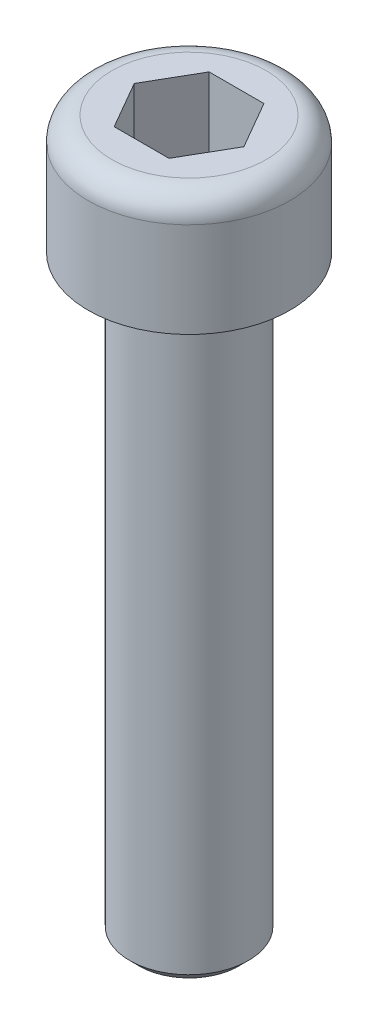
ISO-10303-21;
HEADER;
FILE_DESCRIPTION(('STEP AP214'),'2;1');
FILE_NAME('part.step','',(''),(''),'','','');
FILE_SCHEMA(('AUTOMOTIVE_DESIGN { 1 0 10303 214 1 1 1 1 }'));
ENDSEC;
DATA;
#1=APPLICATION_CONTEXT('core data for automotive mechanical design processes');
#2=APPLICATION_PROTOCOL_DEFINITION('international standard','automotive_design',2000,#1);
#3=PRODUCT_CONTEXT('',#1,'mechanical');
#4=PRODUCT('Part','Part','',(#3));
#5=PRODUCT_RELATED_PRODUCT_CATEGORY('part','',(#4));
#6=PRODUCT_DEFINITION_FORMATION('','',#4);
#7=PRODUCT_DEFINITION_CONTEXT('part definition',#1,'design');
#8=PRODUCT_DEFINITION('design','',#6,#7);
#9=PRODUCT_DEFINITION_SHAPE('','',#8);
#10=(LENGTH_UNIT() NAMED_UNIT(*) SI_UNIT(.MILLI.,.METRE.));
#11=(NAMED_UNIT(*) PLANE_ANGLE_UNIT() SI_UNIT($,.RADIAN.));
#12=(NAMED_UNIT(*) SI_UNIT($,.STERADIAN.) SOLID_ANGLE_UNIT());
#13=UNCERTAINTY_MEASURE_WITH_UNIT(LENGTH_MEASURE(1.E-05),#10,'distance_accuracy_value','');
#14=(GEOMETRIC_REPRESENTATION_CONTEXT(3) GLOBAL_UNCERTAINTY_ASSIGNED_CONTEXT((#13)) GLOBAL_UNIT_ASSIGNED_CONTEXT((#10,
#11,#12)) REPRESENTATION_CONTEXT('',''));
#15=CARTESIAN_POINT('',(0.,0.,0.));
#16=DIRECTION('',(0.,0.,1.));
#17=DIRECTION('',(1.,0.,0.));
#18=AXIS2_PLACEMENT_3D('',#15,#16,#17);
#19=CARTESIAN_POINT('',(0.,5.,0.));
#20=DIRECTION('',(0.,-1.,0.));
#21=DIRECTION('',(1.,0.,0.));
#22=AXIS2_PLACEMENT_3D('',#19,#20,#21);
#23=PLANE('',#22);
#24=DIRECTION('',(-0.5,0.,-0.866025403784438));
#25=VECTOR('',#24,1.);
#26=CARTESIAN_POINT('',(2.3094010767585,5.,0.));
#27=LINE('',#26,#25);
#28=CARTESIAN_POINT('',(2.3094010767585,5.,0.));
#29=VERTEX_POINT('',#28);
#30=CARTESIAN_POINT('',(1.15470053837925,5.,-2.));
#31=VERTEX_POINT('',#30);
#32=EDGE_CURVE('E122',#29,#31,#27,.T.);
#33=ORIENTED_EDGE('',*,*,#32,.F.);
#34=DIRECTION('',(0.5,0.,-0.866025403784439));
#35=VECTOR('',#34,1.);
#36=CARTESIAN_POINT('',(1.15470053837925,5.,2.));
#37=LINE('',#36,#35);
#38=CARTESIAN_POINT('',(1.15470053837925,5.,2.));
#39=VERTEX_POINT('',#38);
#40=EDGE_CURVE('E48',#39,#29,#37,.T.);
#41=ORIENTED_EDGE('',*,*,#40,.F.);
#42=DIRECTION('',(1.,0.,0.));
#43=VECTOR('',#42,1.);
#44=CARTESIAN_POINT('',(-1.15470053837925,5.,2.));
#45=LINE('',#44,#43);
#46=CARTESIAN_POINT('',(-1.15470053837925,5.,2.));
#47=VERTEX_POINT('',#46);
#48=EDGE_CURVE('E131',#47,#39,#45,.T.);
#49=ORIENTED_EDGE('',*,*,#48,.F.);
#50=DIRECTION('',(0.5,0.,0.866025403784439));
#51=VECTOR('',#50,1.);
#52=CARTESIAN_POINT('',(-2.3094010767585,5.,0.));
#53=LINE('',#52,#51);
#54=CARTESIAN_POINT('',(-2.3094010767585,5.,0.));
#55=VERTEX_POINT('',#54);
#56=EDGE_CURVE('E129',#55,#47,#53,.T.);
#57=ORIENTED_EDGE('',*,*,#56,.F.);
#58=DIRECTION('',(-0.5,0.,0.866025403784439));
#59=VECTOR('',#58,1.);
#60=CARTESIAN_POINT('',(-1.15470053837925,5.,-2.));
#61=LINE('',#60,#59);
#62=CARTESIAN_POINT('',(-1.15470053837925,5.,-2.));
#63=VERTEX_POINT('',#62);
#64=EDGE_CURVE('E96',#63,#55,#61,.T.);
#65=ORIENTED_EDGE('',*,*,#64,.F.);
#66=DIRECTION('',(-1.,0.,0.));
#67=VECTOR('',#66,1.);
#68=CARTESIAN_POINT('',(1.15470053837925,5.,-2.));
#69=LINE('',#68,#67);
#70=EDGE_CURVE('E125',#31,#63,#69,.T.);
#71=ORIENTED_EDGE('',*,*,#70,.F.);
#72=EDGE_LOOP('',(#33,#41,#49,#57,#65,#71));
#73=FACE_BOUND('',#72,.T.);
#74=CARTESIAN_POINT('',(0.,5.,0.));
#75=DIRECTION('',(0.,1.,0.));
#76=DIRECTION('',(-1.,0.,0.));
#77=AXIS2_PLACEMENT_3D('',#74,#75,#76);
#78=CIRCLE('',#77,3.25);
#79=CARTESIAN_POINT('',(-3.24999999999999,5.,0.));
#80=VERTEX_POINT('',#79);
#81=EDGE_CURVE('E11',#80,#80,#78,.T.);
#82=ORIENTED_EDGE('',*,*,#81,.T.);
#83=EDGE_LOOP('',(#82));
#84=FACE_BOUND('',#83,.T.);
#85=ADVANCED_FACE('F34',(#73,#84),#23,.F.);
#86=CARTESIAN_POINT('',(0.,4.,0.));
#87=DIRECTION('',(0.,1.,0.));
#88=DIRECTION('',(-1.,0.,0.));
#89=AXIS2_PLACEMENT_3D('',#86,#87,#88);
#90=TOROIDAL_SURFACE('',#89,3.25,1.);
#91=ORIENTED_EDGE('',*,*,#81,.F.);
#92=EDGE_LOOP('',(#91));
#93=FACE_BOUND('',#92,.T.);
#94=CARTESIAN_POINT('',(0.,4.,0.));
#95=DIRECTION('',(0.,1.,0.));
#96=DIRECTION('',(-1.,0.,0.));
#97=AXIS2_PLACEMENT_3D('',#94,#95,#96);
#98=CIRCLE('',#97,4.24999999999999);
#99=CARTESIAN_POINT('',(-4.24999999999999,4.,0.));
#100=VERTEX_POINT('',#99);
#101=EDGE_CURVE('E41',#100,#100,#98,.T.);
#102=ORIENTED_EDGE('',*,*,#101,.T.);
#103=EDGE_LOOP('',(#102));
#104=FACE_BOUND('',#103,.T.);
#105=ADVANCED_FACE('F157',(#93,#104),#90,.T.);
#106=CARTESIAN_POINT('',(0.,5.,0.));
#107=DIRECTION('',(0.,1.,0.));
#108=DIRECTION('',(-1.,0.,0.));
#109=AXIS2_PLACEMENT_3D('',#106,#107,#108);
#110=CYLINDRICAL_SURFACE('',#109,4.24999999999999);
#111=ORIENTED_EDGE('',*,*,#101,.F.);
#112=EDGE_LOOP('',(#111));
#113=FACE_BOUND('',#112,.T.);
#114=CARTESIAN_POINT('',(0.,0.,0.));
#115=DIRECTION('',(0.,1.,0.));
#116=DIRECTION('',(-1.,0.,0.));
#117=AXIS2_PLACEMENT_3D('',#114,#115,#116);
#118=CIRCLE('',#117,4.24999999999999);
#119=CARTESIAN_POINT('',(-4.24999999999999,0.,0.));
#120=VERTEX_POINT('',#119);
#121=EDGE_CURVE('E152',#120,#120,#118,.T.);
#122=ORIENTED_EDGE('',*,*,#121,.T.);
#123=EDGE_LOOP('',(#122));
#124=FACE_BOUND('',#123,.T.);
#125=ADVANCED_FACE('F159',(#113,#124),#110,.T.);
#126=CARTESIAN_POINT('',(4.25,0.,0.));
#127=DIRECTION('',(0.,1.,0.));
#128=DIRECTION('',(-1.,0.,0.));
#129=AXIS2_PLACEMENT_3D('',#126,#127,#128);
#130=PLANE('',#129);
#131=ORIENTED_EDGE('',*,*,#121,.F.);
#132=EDGE_LOOP('',(#131));
#133=FACE_BOUND('',#132,.T.);
#134=CARTESIAN_POINT('',(0.,0.,0.));
#135=DIRECTION('',(0.,1.,0.));
#136=DIRECTION('',(-1.,0.,0.));
#137=AXIS2_PLACEMENT_3D('',#134,#135,#136);
#138=CIRCLE('',#137,2.75);
#139=CARTESIAN_POINT('',(-2.74999999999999,0.,0.));
#140=VERTEX_POINT('',#139);
#141=EDGE_CURVE('E149',#140,#140,#138,.T.);
#142=ORIENTED_EDGE('',*,*,#141,.T.);
#143=EDGE_LOOP('',(#142));
#144=FACE_BOUND('',#143,.T.);
#145=ADVANCED_FACE('F162',(#133,#144),#130,.F.);
#146=CARTESIAN_POINT('',(0.,-0.25,0.));
#147=DIRECTION('',(0.,1.,0.));
#148=DIRECTION('',(-1.,0.,0.));
#149=AXIS2_PLACEMENT_3D('',#146,#147,#148);
#150=TOROIDAL_SURFACE('',#149,2.75,0.25);
#151=ORIENTED_EDGE('',*,*,#141,.F.);
#152=EDGE_LOOP('',(#151));
#153=FACE_BOUND('',#152,.T.);
#154=CARTESIAN_POINT('',(0.,-0.25,0.));
#155=DIRECTION('',(0.,1.,0.));
#156=DIRECTION('',(-1.,0.,0.));
#157=AXIS2_PLACEMENT_3D('',#154,#155,#156);
#158=CIRCLE('',#157,2.5);
#159=CARTESIAN_POINT('',(-2.49999999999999,-0.25,0.));
#160=VERTEX_POINT('',#159);
#161=EDGE_CURVE('E146',#160,#160,#158,.T.);
#162=ORIENTED_EDGE('',*,*,#161,.T.);
#163=EDGE_LOOP('',(#162));
#164=FACE_BOUND('',#163,.T.);
#165=ADVANCED_FACE('F168',(#153,#164),#150,.F.);
#166=CARTESIAN_POINT('',(0.,5.,0.));
#167=DIRECTION('',(0.,1.,0.));
#168=DIRECTION('',(-1.,0.,0.));
#169=AXIS2_PLACEMENT_3D('',#166,#167,#168);
#170=CYLINDRICAL_SURFACE('',#169,2.5);
#171=ORIENTED_EDGE('',*,*,#161,.F.);
#172=EDGE_LOOP('',(#171));
#173=FACE_BOUND('',#172,.T.);
#174=CARTESIAN_POINT('',(0.,-24.6,0.));
#175=DIRECTION('',(0.,1.,0.));
#176=DIRECTION('',(-1.,0.,0.));
#177=AXIS2_PLACEMENT_3D('',#174,#175,#176);
#178=CIRCLE('',#177,2.5);
#179=CARTESIAN_POINT('',(-2.5,-24.6,0.));
#180=VERTEX_POINT('',#179);
#181=EDGE_CURVE('E143',#180,#180,#178,.T.);
#182=ORIENTED_EDGE('',*,*,#181,.T.);
#183=EDGE_LOOP('',(#182));
#184=FACE_BOUND('',#183,.T.);
#185=ADVANCED_FACE('F174',(#173,#184),#170,.T.);
#186=CARTESIAN_POINT('',(0.,-25.,0.));
#187=DIRECTION('',(0.,1.,0.));
#188=DIRECTION('',(-1.,0.,0.));
#189=AXIS2_PLACEMENT_3D('',#186,#187,#188);
#190=CONICAL_SURFACE('',#189,2.1,0.785398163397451);
#191=ORIENTED_EDGE('',*,*,#181,.F.);
#192=EDGE_LOOP('',(#191));
#193=FACE_BOUND('',#192,.T.);
#194=CARTESIAN_POINT('',(0.,-25.,0.));
#195=DIRECTION('',(0.,1.,0.));
#196=DIRECTION('',(-1.,0.,0.));
#197=AXIS2_PLACEMENT_3D('',#194,#195,#196);
#198=CIRCLE('',#197,2.1);
#199=CARTESIAN_POINT('',(-2.1,-25.,0.));
#200=VERTEX_POINT('',#199);
#201=EDGE_CURVE('E135',#200,#200,#198,.T.);
#202=ORIENTED_EDGE('',*,*,#201,.T.);
#203=EDGE_LOOP('',(#202));
#204=FACE_BOUND('',#203,.T.);
#205=ADVANCED_FACE('F180',(#193,#204),#190,.T.);
#206=CARTESIAN_POINT('',(2.1,-25.,0.));
#207=DIRECTION('',(0.,1.,0.));
#208=DIRECTION('',(-1.,0.,0.));
#209=AXIS2_PLACEMENT_3D('',#206,#207,#208);
#210=PLANE('',#209);
#211=ORIENTED_EDGE('',*,*,#201,.F.);
#212=EDGE_LOOP('',(#211));
#213=FACE_BOUND('',#212,.T.);
#214=ADVANCED_FACE('F186',(#213),#210,.F.);
#215=CARTESIAN_POINT('',(1.15470053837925,1.875,2.));
#216=DIRECTION('',(0.866025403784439,0.,0.5));
#217=DIRECTION('',(0.5,0.,-0.866025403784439));
#218=AXIS2_PLACEMENT_3D('',#215,#216,#217);
#219=PLANE('',#218);
#220=ORIENTED_EDGE('',*,*,#40,.T.);
#221=DIRECTION('',(0.,1.,0.));
#222=VECTOR('',#221,1.);
#223=CARTESIAN_POINT('',(2.3094010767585,1.875,0.));
#224=LINE('',#223,#222);
#225=CARTESIAN_POINT('',(2.3094010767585,1.875,0.));
#226=VERTEX_POINT('',#225);
#227=EDGE_CURVE('E78',#226,#29,#224,.T.);
#228=ORIENTED_EDGE('',*,*,#227,.F.);
#229=DIRECTION('',(0.5,0.,-0.866025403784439));
#230=VECTOR('',#229,1.);
#231=CARTESIAN_POINT('',(1.15470053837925,1.875,2.));
#232=LINE('',#231,#230);
#233=CARTESIAN_POINT('',(1.15470053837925,1.875,2.));
#234=VERTEX_POINT('',#233);
#235=EDGE_CURVE('E133',#234,#226,#232,.T.);
#236=ORIENTED_EDGE('',*,*,#235,.F.);
#237=DIRECTION('',(0.,1.,0.));
#238=VECTOR('',#237,1.);
#239=CARTESIAN_POINT('',(1.15470053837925,1.875,2.));
#240=LINE('',#239,#238);
#241=EDGE_CURVE('E56',#234,#39,#240,.T.);
#242=ORIENTED_EDGE('',*,*,#241,.T.);
#243=EDGE_LOOP('',(#220,#228,#236,#242));
#244=FACE_BOUND('',#243,.T.);
#245=ADVANCED_FACE('F191',(#244),#219,.F.);
#246=CARTESIAN_POINT('',(-1.15470053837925,1.875,2.));
#247=DIRECTION('',(0.,0.,1.));
#248=DIRECTION('',(1.,0.,0.));
#249=AXIS2_PLACEMENT_3D('',#246,#247,#248);
#250=PLANE('',#249);
#251=ORIENTED_EDGE('',*,*,#48,.T.);
#252=ORIENTED_EDGE('',*,*,#241,.F.);
#253=DIRECTION('',(1.,0.,0.));
#254=VECTOR('',#253,1.);
#255=CARTESIAN_POINT('',(-1.15470053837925,1.875,2.));
#256=LINE('',#255,#254);
#257=CARTESIAN_POINT('',(-1.15470053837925,1.875,2.));
#258=VERTEX_POINT('',#257);
#259=EDGE_CURVE('E108',#258,#234,#256,.T.);
#260=ORIENTED_EDGE('',*,*,#259,.F.);
#261=DIRECTION('',(0.,1.,0.));
#262=VECTOR('',#261,1.);
#263=CARTESIAN_POINT('',(-1.15470053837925,1.875,2.));
#264=LINE('',#263,#262);
#265=EDGE_CURVE('E100',#258,#47,#264,.T.);
#266=ORIENTED_EDGE('',*,*,#265,.T.);
#267=EDGE_LOOP('',(#251,#252,#260,#266));
#268=FACE_BOUND('',#267,.T.);
#269=ADVANCED_FACE('F196',(#268),#250,.F.);
#270=CARTESIAN_POINT('',(-2.3094010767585,1.875,0.));
#271=DIRECTION('',(-0.866025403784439,0.,0.5));
#272=DIRECTION('',(0.5,0.,0.866025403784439));
#273=AXIS2_PLACEMENT_3D('',#270,#271,#272);
#274=PLANE('',#273);
#275=ORIENTED_EDGE('',*,*,#56,.T.);
#276=ORIENTED_EDGE('',*,*,#265,.F.);
#277=DIRECTION('',(0.5,0.,0.866025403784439));
#278=VECTOR('',#277,1.);
#279=CARTESIAN_POINT('',(-2.3094010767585,1.875,0.));
#280=LINE('',#279,#278);
#281=CARTESIAN_POINT('',(-2.3094010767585,1.875,0.));
#282=VERTEX_POINT('',#281);
#283=EDGE_CURVE('E104',#282,#258,#280,.T.);
#284=ORIENTED_EDGE('',*,*,#283,.F.);
#285=DIRECTION('',(0.,1.,0.));
#286=VECTOR('',#285,1.);
#287=CARTESIAN_POINT('',(-2.3094010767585,1.875,0.));
#288=LINE('',#287,#286);
#289=EDGE_CURVE('E89',#282,#55,#288,.T.);
#290=ORIENTED_EDGE('',*,*,#289,.T.);
#291=EDGE_LOOP('',(#275,#276,#284,#290));
#292=FACE_BOUND('',#291,.T.);
#293=ADVANCED_FACE('F105',(#292),#274,.F.);
#294=CARTESIAN_POINT('',(-1.15470053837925,1.875,-2.));
#295=DIRECTION('',(-0.866025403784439,0.,-0.5));
#296=DIRECTION('',(-0.5,0.,0.866025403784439));
#297=AXIS2_PLACEMENT_3D('',#294,#295,#296);
#298=PLANE('',#297);
#299=ORIENTED_EDGE('',*,*,#64,.T.);
#300=ORIENTED_EDGE('',*,*,#289,.F.);
#301=DIRECTION('',(-0.5,0.,0.866025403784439));
#302=VECTOR('',#301,1.);
#303=CARTESIAN_POINT('',(-1.15470053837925,1.875,-2.));
#304=LINE('',#303,#302);
#305=CARTESIAN_POINT('',(-1.15470053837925,1.875,-2.));
#306=VERTEX_POINT('',#305);
#307=EDGE_CURVE('E93',#306,#282,#304,.T.);
#308=ORIENTED_EDGE('',*,*,#307,.F.);
#309=DIRECTION('',(0.,1.,0.));
#310=VECTOR('',#309,1.);
#311=CARTESIAN_POINT('',(-1.15470053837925,1.875,-2.));
#312=LINE('',#311,#310);
#313=EDGE_CURVE('E101',#306,#63,#312,.T.);
#314=ORIENTED_EDGE('',*,*,#313,.T.);
#315=EDGE_LOOP('',(#299,#300,#308,#314));
#316=FACE_BOUND('',#315,.T.);
#317=ADVANCED_FACE('F91',(#316),#298,.F.);
#318=CARTESIAN_POINT('',(1.15470053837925,1.875,-2.));
#319=DIRECTION('',(0.,0.,-1.));
#320=DIRECTION('',(-1.,0.,0.));
#321=AXIS2_PLACEMENT_3D('',#318,#319,#320);
#322=PLANE('',#321);
#323=ORIENTED_EDGE('',*,*,#70,.T.);
#324=ORIENTED_EDGE('',*,*,#313,.F.);
#325=DIRECTION('',(-1.,0.,0.));
#326=VECTOR('',#325,1.);
#327=CARTESIAN_POINT('',(1.15470053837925,1.875,-2.));
#328=LINE('',#327,#326);
#329=CARTESIAN_POINT('',(1.15470053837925,1.875,-2.));
#330=VERTEX_POINT('',#329);
#331=EDGE_CURVE('E114',#330,#306,#328,.T.);
#332=ORIENTED_EDGE('',*,*,#331,.F.);
#333=DIRECTION('',(0.,1.,0.));
#334=VECTOR('',#333,1.);
#335=CARTESIAN_POINT('',(1.15470053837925,1.875,-2.));
#336=LINE('',#335,#334);
#337=EDGE_CURVE('E138',#330,#31,#336,.T.);
#338=ORIENTED_EDGE('',*,*,#337,.T.);
#339=EDGE_LOOP('',(#323,#324,#332,#338));
#340=FACE_BOUND('',#339,.T.);
#341=ADVANCED_FACE('F222',(#340),#322,.F.);
#342=CARTESIAN_POINT('',(2.3094010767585,1.875,0.));
#343=DIRECTION('',(0.866025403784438,0.,-0.5));
#344=DIRECTION('',(-0.5,0.,-0.866025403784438));
#345=AXIS2_PLACEMENT_3D('',#342,#343,#344);
#346=PLANE('',#345);
#347=ORIENTED_EDGE('',*,*,#32,.T.);
#348=ORIENTED_EDGE('',*,*,#337,.F.);
#349=DIRECTION('',(-0.5,0.,-0.866025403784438));
#350=VECTOR('',#349,1.);
#351=CARTESIAN_POINT('',(2.3094010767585,1.875,0.));
#352=LINE('',#351,#350);
#353=EDGE_CURVE('E116',#226,#330,#352,.T.);
#354=ORIENTED_EDGE('',*,*,#353,.F.);
#355=ORIENTED_EDGE('',*,*,#227,.T.);
#356=EDGE_LOOP('',(#347,#348,#354,#355));
#357=FACE_BOUND('',#356,.T.);
#358=ADVANCED_FACE('F210',(#357),#346,.F.);
#359=CARTESIAN_POINT('',(2.3094010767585,1.875,0.));
#360=DIRECTION('',(0.,1.,0.));
#361=DIRECTION('',(0.,0.,1.));
#362=AXIS2_PLACEMENT_3D('',#359,#360,#361);
#363=PLANE('',#362);
#364=ORIENTED_EDGE('',*,*,#235,.T.);
#365=ORIENTED_EDGE('',*,*,#353,.T.);
#366=ORIENTED_EDGE('',*,*,#331,.T.);
#367=ORIENTED_EDGE('',*,*,#307,.T.);
#368=ORIENTED_EDGE('',*,*,#283,.T.);
#369=ORIENTED_EDGE('',*,*,#259,.T.);
#370=EDGE_LOOP('',(#364,#365,#366,#367,#368,#369));
#371=FACE_BOUND('',#370,.T.);
#372=ADVANCED_FACE('F111',(#371),#363,.T.);
#373=CLOSED_SHELL('',(#85,#105,#125,#145,#165,#185,#205,#214,#245,#269,#293,#317,#341,#358,#372));
#374=MANIFOLD_SOLID_BREP('B2',#373);
#375=ADVANCED_BREP_SHAPE_REPRESENTATION('',(#18,#374),#14);
#376=SHAPE_DEFINITION_REPRESENTATION(#9,#375);
ENDSEC;
END-ISO-10303-21;
